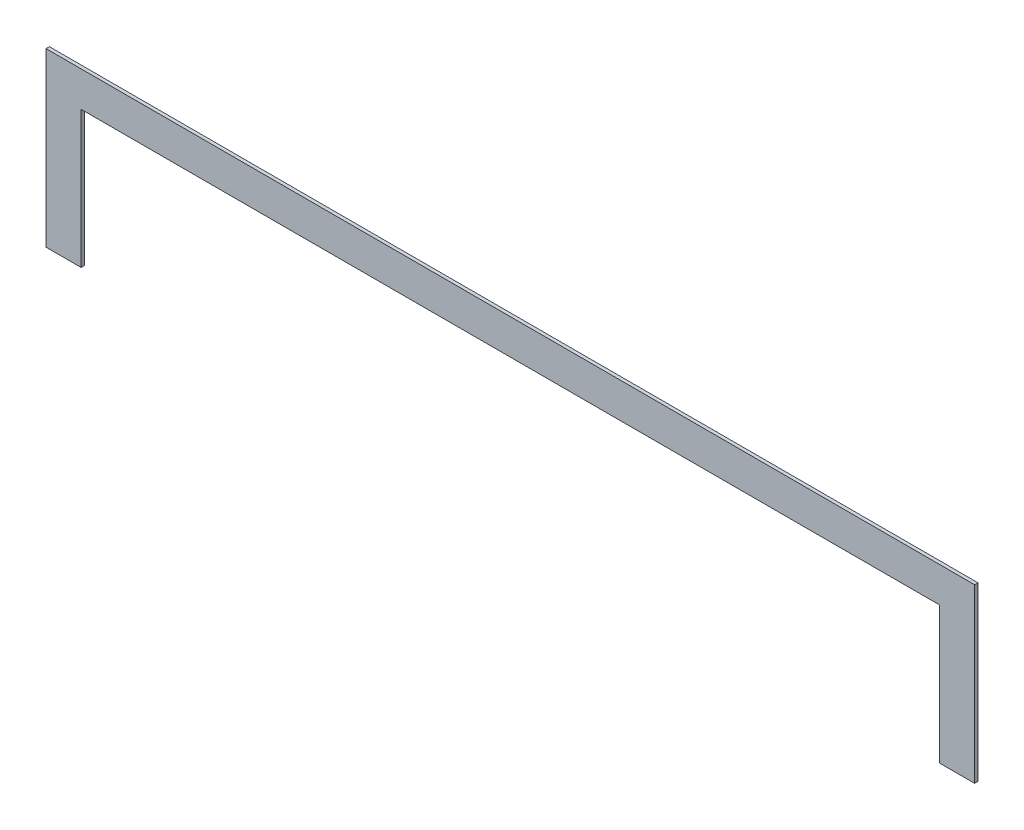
ISO-10303-21;
HEADER;
FILE_DESCRIPTION(('STEP AP214'),'2;1');
FILE_NAME('part.step','',(''),(''),'','','');
FILE_SCHEMA(('AUTOMOTIVE_DESIGN { 1 0 10303 214 1 1 1 1 }'));
ENDSEC;
DATA;
#1=APPLICATION_CONTEXT('core data for automotive mechanical design processes');
#2=APPLICATION_PROTOCOL_DEFINITION('international standard','automotive_design',2000,#1);
#3=PRODUCT_CONTEXT('',#1,'mechanical');
#4=PRODUCT('Part','Part','',(#3));
#5=PRODUCT_RELATED_PRODUCT_CATEGORY('part','',(#4));
#6=PRODUCT_DEFINITION_FORMATION('','',#4);
#7=PRODUCT_DEFINITION_CONTEXT('part definition',#1,'design');
#8=PRODUCT_DEFINITION('design','',#6,#7);
#9=PRODUCT_DEFINITION_SHAPE('','',#8);
#10=(LENGTH_UNIT() NAMED_UNIT(*) SI_UNIT(.MILLI.,.METRE.));
#11=(NAMED_UNIT(*) PLANE_ANGLE_UNIT() SI_UNIT($,.RADIAN.));
#12=(NAMED_UNIT(*) SI_UNIT($,.STERADIAN.) SOLID_ANGLE_UNIT());
#13=UNCERTAINTY_MEASURE_WITH_UNIT(LENGTH_MEASURE(1.E-05),#10,'distance_accuracy_value','');
#14=(GEOMETRIC_REPRESENTATION_CONTEXT(3) GLOBAL_UNCERTAINTY_ASSIGNED_CONTEXT((#13)) GLOBAL_UNIT_ASSIGNED_CONTEXT((#10,
#11,#12)) REPRESENTATION_CONTEXT('',''));
#15=CARTESIAN_POINT('',(0.,0.,0.));
#16=DIRECTION('',(0.,0.,1.));
#17=DIRECTION('',(1.,0.,0.));
#18=AXIS2_PLACEMENT_3D('',#15,#16,#17);
#19=CARTESIAN_POINT('',(0.,78.778002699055,2.));
#20=DIRECTION('',(0.,0.,1.));
#21=DIRECTION('',(1.,0.,0.));
#22=AXIS2_PLACEMENT_3D('',#19,#20,#21);
#23=PLANE('',#22);
#24=DIRECTION('',(1.,0.,0.));
#25=VECTOR('',#24,1.);
#26=CARTESIAN_POINT('',(-278.,0.,2.));
#27=LINE('',#26,#25);
#28=CARTESIAN_POINT('',(-278.,0.,2.));
#29=VERTEX_POINT('',#28);
#30=CARTESIAN_POINT('',(-257.,0.,2.));
#31=VERTEX_POINT('',#30);
#32=EDGE_CURVE('E112',#29,#31,#27,.T.);
#33=ORIENTED_EDGE('',*,*,#32,.T.);
#34=DIRECTION('',(0.,1.,0.));
#35=VECTOR('',#34,1.);
#36=CARTESIAN_POINT('',(-257.,0.,2.));
#37=LINE('',#36,#35);
#38=CARTESIAN_POINT('',(-257.,82.,2.));
#39=VERTEX_POINT('',#38);
#40=EDGE_CURVE('E145',#31,#39,#37,.T.);
#41=ORIENTED_EDGE('',*,*,#40,.T.);
#42=DIRECTION('',(1.,0.,0.));
#43=VECTOR('',#42,1.);
#44=CARTESIAN_POINT('',(-257.,82.,2.));
#45=LINE('',#44,#43);
#46=CARTESIAN_POINT('',(257.,82.,2.));
#47=VERTEX_POINT('',#46);
#48=EDGE_CURVE('E142',#39,#47,#45,.T.);
#49=ORIENTED_EDGE('',*,*,#48,.T.);
#50=DIRECTION('',(0.,-1.,0.));
#51=VECTOR('',#50,1.);
#52=CARTESIAN_POINT('',(257.,82.,2.));
#53=LINE('',#52,#51);
#54=CARTESIAN_POINT('',(257.,0.,2.));
#55=VERTEX_POINT('',#54);
#56=EDGE_CURVE('E136',#47,#55,#53,.T.);
#57=ORIENTED_EDGE('',*,*,#56,.T.);
#58=DIRECTION('',(1.,0.,0.));
#59=VECTOR('',#58,1.);
#60=CARTESIAN_POINT('',(257.,0.,2.));
#61=LINE('',#60,#59);
#62=CARTESIAN_POINT('',(278.,0.,2.));
#63=VERTEX_POINT('',#62);
#64=EDGE_CURVE('E127',#55,#63,#61,.T.);
#65=ORIENTED_EDGE('',*,*,#64,.T.);
#66=DIRECTION('',(0.,1.,0.));
#67=VECTOR('',#66,1.);
#68=CARTESIAN_POINT('',(278.,0.,2.));
#69=LINE('',#68,#67);
#70=CARTESIAN_POINT('',(278.,103.,2.));
#71=VERTEX_POINT('',#70);
#72=EDGE_CURVE('E182',#63,#71,#69,.T.);
#73=ORIENTED_EDGE('',*,*,#72,.T.);
#74=DIRECTION('',(-1.,0.,0.));
#75=VECTOR('',#74,1.);
#76=CARTESIAN_POINT('',(278.,103.,2.));
#77=LINE('',#76,#75);
#78=CARTESIAN_POINT('',(-278.,103.,2.));
#79=VERTEX_POINT('',#78);
#80=EDGE_CURVE('E105',#71,#79,#77,.T.);
#81=ORIENTED_EDGE('',*,*,#80,.T.);
#82=DIRECTION('',(0.,-1.,0.));
#83=VECTOR('',#82,1.);
#84=CARTESIAN_POINT('',(-278.,103.,2.));
#85=LINE('',#84,#83);
#86=EDGE_CURVE('E10',#79,#29,#85,.T.);
#87=ORIENTED_EDGE('',*,*,#86,.T.);
#88=EDGE_LOOP('',(#33,#41,#49,#57,#65,#73,#81,#87));
#89=FACE_BOUND('',#88,.T.);
#90=ADVANCED_FACE('F16',(#89),#23,.T.);
#91=CARTESIAN_POINT('',(0.,78.778002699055,0.));
#92=DIRECTION('',(0.,0.,1.));
#93=DIRECTION('',(1.,0.,0.));
#94=AXIS2_PLACEMENT_3D('',#91,#92,#93);
#95=PLANE('',#94);
#96=DIRECTION('',(0.,-1.,0.));
#97=VECTOR('',#96,1.);
#98=CARTESIAN_POINT('',(-278.,103.,0.));
#99=LINE('',#98,#97);
#100=CARTESIAN_POINT('',(-278.,103.,0.));
#101=VERTEX_POINT('',#100);
#102=CARTESIAN_POINT('',(-278.,0.,0.));
#103=VERTEX_POINT('',#102);
#104=EDGE_CURVE('E24',#101,#103,#99,.T.);
#105=ORIENTED_EDGE('',*,*,#104,.F.);
#106=DIRECTION('',(-1.,0.,0.));
#107=VECTOR('',#106,1.);
#108=CARTESIAN_POINT('',(278.,103.,0.));
#109=LINE('',#108,#107);
#110=CARTESIAN_POINT('',(278.,103.,0.));
#111=VERTEX_POINT('',#110);
#112=EDGE_CURVE('E186',#111,#101,#109,.T.);
#113=ORIENTED_EDGE('',*,*,#112,.F.);
#114=DIRECTION('',(0.,1.,0.));
#115=VECTOR('',#114,1.);
#116=CARTESIAN_POINT('',(278.,0.,0.));
#117=LINE('',#116,#115);
#118=CARTESIAN_POINT('',(278.,0.,0.));
#119=VERTEX_POINT('',#118);
#120=EDGE_CURVE('E129',#119,#111,#117,.T.);
#121=ORIENTED_EDGE('',*,*,#120,.F.);
#122=DIRECTION('',(1.,0.,0.));
#123=VECTOR('',#122,1.);
#124=CARTESIAN_POINT('',(257.,0.,0.));
#125=LINE('',#124,#123);
#126=CARTESIAN_POINT('',(257.,0.,0.));
#127=VERTEX_POINT('',#126);
#128=EDGE_CURVE('E132',#127,#119,#125,.T.);
#129=ORIENTED_EDGE('',*,*,#128,.F.);
#130=DIRECTION('',(0.,-1.,0.));
#131=VECTOR('',#130,1.);
#132=CARTESIAN_POINT('',(257.,82.,0.));
#133=LINE('',#132,#131);
#134=CARTESIAN_POINT('',(257.,82.,0.));
#135=VERTEX_POINT('',#134);
#136=EDGE_CURVE('E137',#135,#127,#133,.T.);
#137=ORIENTED_EDGE('',*,*,#136,.F.);
#138=DIRECTION('',(1.,0.,0.));
#139=VECTOR('',#138,1.);
#140=CARTESIAN_POINT('',(-257.,82.,0.));
#141=LINE('',#140,#139);
#142=CARTESIAN_POINT('',(-257.,82.,0.));
#143=VERTEX_POINT('',#142);
#144=EDGE_CURVE('E149',#143,#135,#141,.T.);
#145=ORIENTED_EDGE('',*,*,#144,.F.);
#146=DIRECTION('',(0.,1.,0.));
#147=VECTOR('',#146,1.);
#148=CARTESIAN_POINT('',(-257.,0.,0.));
#149=LINE('',#148,#147);
#150=CARTESIAN_POINT('',(-257.,0.,0.));
#151=VERTEX_POINT('',#150);
#152=EDGE_CURVE('E114',#151,#143,#149,.T.);
#153=ORIENTED_EDGE('',*,*,#152,.F.);
#154=DIRECTION('',(1.,0.,0.));
#155=VECTOR('',#154,1.);
#156=CARTESIAN_POINT('',(-278.,0.,0.));
#157=LINE('',#156,#155);
#158=EDGE_CURVE('E110',#103,#151,#157,.T.);
#159=ORIENTED_EDGE('',*,*,#158,.F.);
#160=EDGE_LOOP('',(#105,#113,#121,#129,#137,#145,#153,#159));
#161=FACE_BOUND('',#160,.T.);
#162=ADVANCED_FACE('F116',(#161),#95,.F.);
#163=CARTESIAN_POINT('',(-278.,103.,0.));
#164=DIRECTION('',(1.,0.,0.));
#165=DIRECTION('',(0.,1.,0.));
#166=AXIS2_PLACEMENT_3D('',#163,#164,#165);
#167=PLANE('',#166);
#168=ORIENTED_EDGE('',*,*,#104,.T.);
#169=DIRECTION('',(0.,0.,1.));
#170=VECTOR('',#169,1.);
#171=CARTESIAN_POINT('',(-278.,0.,0.));
#172=LINE('',#171,#170);
#173=EDGE_CURVE('E99',#103,#29,#172,.T.);
#174=ORIENTED_EDGE('',*,*,#173,.T.);
#175=ORIENTED_EDGE('',*,*,#86,.F.);
#176=DIRECTION('',(0.,0.,1.));
#177=VECTOR('',#176,1.);
#178=CARTESIAN_POINT('',(-278.,103.,0.));
#179=LINE('',#178,#177);
#180=EDGE_CURVE('E102',#101,#79,#179,.T.);
#181=ORIENTED_EDGE('',*,*,#180,.F.);
#182=EDGE_LOOP('',(#168,#174,#175,#181));
#183=FACE_BOUND('',#182,.T.);
#184=ADVANCED_FACE('F98',(#183),#167,.F.);
#185=CARTESIAN_POINT('',(278.,103.,0.));
#186=DIRECTION('',(0.,-1.,0.));
#187=DIRECTION('',(0.,0.,-1.));
#188=AXIS2_PLACEMENT_3D('',#185,#186,#187);
#189=PLANE('',#188);
#190=ORIENTED_EDGE('',*,*,#112,.T.);
#191=ORIENTED_EDGE('',*,*,#180,.T.);
#192=ORIENTED_EDGE('',*,*,#80,.F.);
#193=DIRECTION('',(0.,0.,1.));
#194=VECTOR('',#193,1.);
#195=CARTESIAN_POINT('',(278.,103.,0.));
#196=LINE('',#195,#194);
#197=EDGE_CURVE('E154',#111,#71,#196,.T.);
#198=ORIENTED_EDGE('',*,*,#197,.F.);
#199=EDGE_LOOP('',(#190,#191,#192,#198));
#200=FACE_BOUND('',#199,.T.);
#201=ADVANCED_FACE('F196',(#200),#189,.F.);
#202=CARTESIAN_POINT('',(278.,0.,0.));
#203=DIRECTION('',(-1.,0.,0.));
#204=DIRECTION('',(0.,0.,1.));
#205=AXIS2_PLACEMENT_3D('',#202,#203,#204);
#206=PLANE('',#205);
#207=ORIENTED_EDGE('',*,*,#120,.T.);
#208=ORIENTED_EDGE('',*,*,#197,.T.);
#209=ORIENTED_EDGE('',*,*,#72,.F.);
#210=DIRECTION('',(0.,0.,1.));
#211=VECTOR('',#210,1.);
#212=CARTESIAN_POINT('',(278.,0.,0.));
#213=LINE('',#212,#211);
#214=EDGE_CURVE('E130',#119,#63,#213,.T.);
#215=ORIENTED_EDGE('',*,*,#214,.F.);
#216=EDGE_LOOP('',(#207,#208,#209,#215));
#217=FACE_BOUND('',#216,.T.);
#218=ADVANCED_FACE('F200',(#217),#206,.F.);
#219=CARTESIAN_POINT('',(257.,0.,0.));
#220=DIRECTION('',(0.,1.,0.));
#221=DIRECTION('',(1.,0.,0.));
#222=AXIS2_PLACEMENT_3D('',#219,#220,#221);
#223=PLANE('',#222);
#224=ORIENTED_EDGE('',*,*,#128,.T.);
#225=ORIENTED_EDGE('',*,*,#214,.T.);
#226=ORIENTED_EDGE('',*,*,#64,.F.);
#227=DIRECTION('',(0.,0.,1.));
#228=VECTOR('',#227,1.);
#229=CARTESIAN_POINT('',(257.,0.,0.));
#230=LINE('',#229,#228);
#231=EDGE_CURVE('E141',#127,#55,#230,.T.);
#232=ORIENTED_EDGE('',*,*,#231,.F.);
#233=EDGE_LOOP('',(#224,#225,#226,#232));
#234=FACE_BOUND('',#233,.T.);
#235=ADVANCED_FACE('F202',(#234),#223,.F.);
#236=CARTESIAN_POINT('',(257.,82.,0.));
#237=DIRECTION('',(1.,0.,0.));
#238=DIRECTION('',(0.,1.,0.));
#239=AXIS2_PLACEMENT_3D('',#236,#237,#238);
#240=PLANE('',#239);
#241=ORIENTED_EDGE('',*,*,#136,.T.);
#242=ORIENTED_EDGE('',*,*,#231,.T.);
#243=ORIENTED_EDGE('',*,*,#56,.F.);
#244=DIRECTION('',(0.,0.,1.));
#245=VECTOR('',#244,1.);
#246=CARTESIAN_POINT('',(257.,82.,0.));
#247=LINE('',#246,#245);
#248=EDGE_CURVE('E163',#135,#47,#247,.T.);
#249=ORIENTED_EDGE('',*,*,#248,.F.);
#250=EDGE_LOOP('',(#241,#242,#243,#249));
#251=FACE_BOUND('',#250,.T.);
#252=ADVANCED_FACE('F205',(#251),#240,.F.);
#253=CARTESIAN_POINT('',(-257.,82.,0.));
#254=DIRECTION('',(0.,1.,0.));
#255=DIRECTION('',(1.,0.,0.));
#256=AXIS2_PLACEMENT_3D('',#253,#254,#255);
#257=PLANE('',#256);
#258=ORIENTED_EDGE('',*,*,#144,.T.);
#259=ORIENTED_EDGE('',*,*,#248,.T.);
#260=ORIENTED_EDGE('',*,*,#48,.F.);
#261=DIRECTION('',(0.,0.,1.));
#262=VECTOR('',#261,1.);
#263=CARTESIAN_POINT('',(-257.,82.,0.));
#264=LINE('',#263,#262);
#265=EDGE_CURVE('E150',#143,#39,#264,.T.);
#266=ORIENTED_EDGE('',*,*,#265,.F.);
#267=EDGE_LOOP('',(#258,#259,#260,#266));
#268=FACE_BOUND('',#267,.T.);
#269=ADVANCED_FACE('F208',(#268),#257,.F.);
#270=CARTESIAN_POINT('',(-257.,0.,0.));
#271=DIRECTION('',(-1.,0.,0.));
#272=DIRECTION('',(0.,0.,1.));
#273=AXIS2_PLACEMENT_3D('',#270,#271,#272);
#274=PLANE('',#273);
#275=ORIENTED_EDGE('',*,*,#152,.T.);
#276=ORIENTED_EDGE('',*,*,#265,.T.);
#277=ORIENTED_EDGE('',*,*,#40,.F.);
#278=DIRECTION('',(0.,0.,1.));
#279=VECTOR('',#278,1.);
#280=CARTESIAN_POINT('',(-257.,0.,0.));
#281=LINE('',#280,#279);
#282=EDGE_CURVE('E120',#151,#31,#281,.T.);
#283=ORIENTED_EDGE('',*,*,#282,.F.);
#284=EDGE_LOOP('',(#275,#276,#277,#283));
#285=FACE_BOUND('',#284,.T.);
#286=ADVANCED_FACE('F210',(#285),#274,.F.);
#287=CARTESIAN_POINT('',(-278.,0.,0.));
#288=DIRECTION('',(0.,1.,0.));
#289=DIRECTION('',(1.,0.,0.));
#290=AXIS2_PLACEMENT_3D('',#287,#288,#289);
#291=PLANE('',#290);
#292=ORIENTED_EDGE('',*,*,#158,.T.);
#293=ORIENTED_EDGE('',*,*,#282,.T.);
#294=ORIENTED_EDGE('',*,*,#32,.F.);
#295=ORIENTED_EDGE('',*,*,#173,.F.);
#296=EDGE_LOOP('',(#292,#293,#294,#295));
#297=FACE_BOUND('',#296,.T.);
#298=ADVANCED_FACE('F108',(#297),#291,.F.);
#299=CLOSED_SHELL('',(#90,#162,#184,#201,#218,#235,#252,#269,#286,#298));
#300=MANIFOLD_SOLID_BREP('B1',#299);
#301=ADVANCED_BREP_SHAPE_REPRESENTATION('',(#18,#300),#14);
#302=SHAPE_DEFINITION_REPRESENTATION(#9,#301);
ENDSEC;
END-ISO-10303-21;
